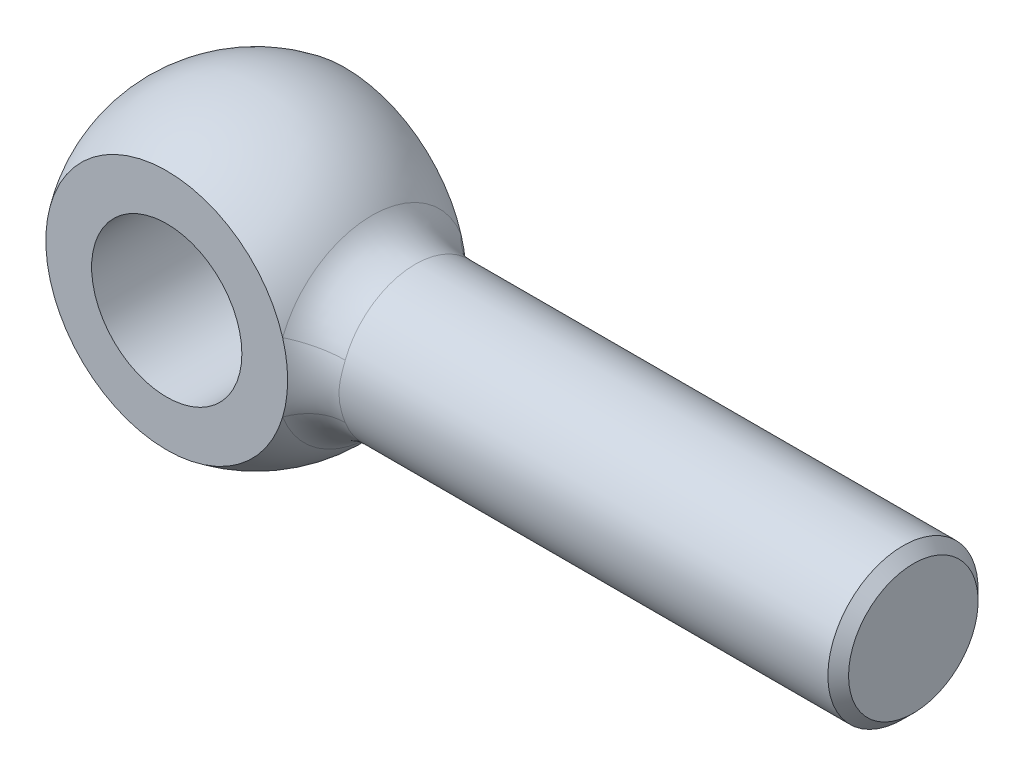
from build123d import *

# Parameters (mm, degrees)
PUPILSKE_R  = 8
PUPIL_DEPTH = 75.276510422
FILLET1_R   = 6


with BuildPart() as part:
    # BodySke → Base-Revolve (revolve)
    with BuildSketch(Plane.XY, mode=Mode.PRIVATE) as base_revolve_sk:
        Polygon((0, 0), (0, 8), (68.8985, 8), (70, 6.8985), (70, 0), align=None)
    revolve(base_revolve_sk.sketch.rotate(Axis((-31.75, 0, 0), (1, 0, 0)), 90), axis=Axis((-31.75, 0, 0), (1, 0, 0)))

    # EyeSke → Eye (revolve)
    with BuildSketch(Plane(origin=(0, 0, 0), x_dir=(0, 0, -1), z_dir=(1, 0, 0)), mode=Mode.PRIVATE) as eye_sk:
        with BuildLine():
            Line((9.5, 0), (-9.5, 0))
            Line((-9.5, 0), (-9.5, 12.87439319))
            ThreePointArc((-9.5, 12.87439319), (0, 16), (9.5, 12.87439319))
            Line((9.5, 12.87439319), (9.5, 0))
        make_face()
    revolve(eye_sk.sketch.rotate(Axis((0, 0, -9.5), (0, 0, 1)), 90), axis=Axis((0, 0, -9.5), (0, 0, 1)))

    # PupilSke → Pupil (cut, through all)
    with BuildSketch(Plane.XY.offset(9.5)):
        Circle(PUPILSKE_R)
    extrude(amount=-PUPIL_DEPTH, mode=Mode.SUBTRACT)

    # Fillet1
    fillet1_edges = [part.edges().sort_by_distance(p)[0] for p in [
        (13.856406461, 0, -8),
    ]]
    fillet(fillet1_edges, radius=FILLET1_R)


solid = part.part
